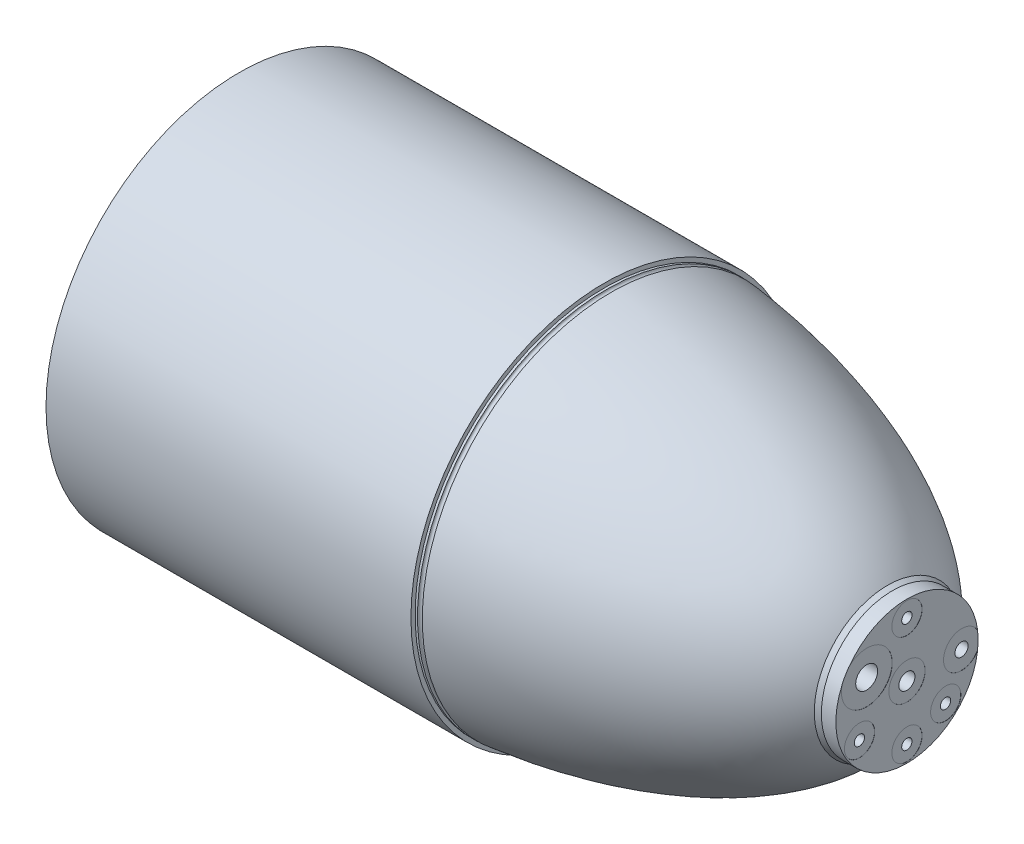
from build123d import *

# Parameters (mm, degrees)
SKETCH2_R         = 13.335
ANT_LAND_DEPTH    = 0.0762
SKETCH3_R         = 5.7531
ANT_THRU_DEPTH    = 25.4
SKETCH4_R         = 4.2164
HYD_THRU_DEPTH    = 50.8
SKETCH5_R         = 9.525
HYD_LAND_DEPTH    = 0.0508
SKETCH6_R         = 7.9375
B_LAND_DEPTH      = 0.0762
SKETCH7_R         = 2.7051
B_THRU_DEPTH      = 50.8
SKETCH8_R         = 9.525
PRESS_LAND_DEPTH  = 0.0762
SKETCH9_R         = 3.4544
PRESS_THRU_DEPTH  = 50.8
SKETCH10_R        = 7.9375
C_LAND_DEPTH      = 0.0762
SKETCH11_R        = 2.7051
C_THRU_DEPTH      = 50.8
SKETCH12_R        = 7.9375
D_LAND_DEPTH      = 0.0762
SKETCH13_R        = 2.7051
D_THRU_DEPTH      = 50.8
SKETCH14_R        = 7.9375
E_LAND_DEPTH      = 0.0762
SKETCH15_R        = 2.7051
E_THRU_DEPTH      = 50.8
INTERIOR_BC_REACH = 345.704
SKETCH19_R        = 2.159


with BuildPart() as part:
    # Sketch1 → Base-Revolve (revolve)
    with BuildSketch(Plane.XY, mode=Mode.PRIVATE) as base_revolve_sk:
        with BuildLine():
            Line((326.394218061, -0.004506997), (350.52, -0.004506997))
            Line((350.52, -0.004506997), (350.52, -37.342506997))
            Line((350.52, -37.342506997), (346.456, -37.342506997))
            Line((346.456, -37.342506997), (342.9, -37.342506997))
            Line((342.9, -37.342506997), (340.36, -38.508146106))
            add(Edge.make_bspline(
                [(195.203659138, -99.071997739), (299.731305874, -87.838190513), (340.36, -38.508146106)],
                knots=[4.924626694, 4.924626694, 4.924626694, 5.893424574, 5.893424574, 5.893424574], degree=2, weights=[1, 0.884955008, 1]))
            ThreePointArc((195.203659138, -99.071997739), (193.957327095, -97.900670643), (192.786, -99.147002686))
            Line((192.786, -99.147002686), (191.516, -99.147002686))
            Line((191.516, -99.147002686), (191.516, -101.346))
            Line((191.516, -101.346), (0, -101.346))
            Line((0, -101.346), (0, -95.5294))
            Line((0, -95.5294), (2.032, -95.5294))
            ThreePointArc((2.032, -95.5294), (3.683, -97.1804), (5.334, -95.5294))
            Line((5.334, -95.5294), (25.9334, -95.5294))
            Line((25.9334, -95.5294), (28.4734, -94.996))
            Line((28.4734, -94.996), (38.1254, -94.996))
            Line((38.1254, -94.996), (38.1254, -87.63))
            Line((38.1254, -87.63), (44.4754, -87.63))
            Line((44.4754, -87.63), (44.4754, -94.996))
            Line((44.4754, -94.996), (181.8894, -94.996))
            Line((181.8894, -94.996), (187.9854, -89.154))
            Line((187.9854, -89.154), (214.293552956, -89.154))
            add(Edge.make_bspline(
                [(214.293552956, -89.154), (289.960887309, -77.024720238), (326.394218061, -42.927072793)],
                knots=[5.034372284, 5.034372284, 5.034372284, 5.808847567, 5.808847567, 5.808847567], degree=2, weights=[1, 0.925955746, 1]))
            Line((326.394218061, -42.927072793), (326.394218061, -0.004506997))
        make_face()
    revolve(base_revolve_sk.sketch.rotate(Axis((355.6, 0, 0), (-1, 0, 0)), 270), axis=Axis((355.6, 0, 0), (-1, 0, 0)))

    # Sketch2 → ANT_LAND (cut)
    with BuildSketch(Plane(origin=(350.52, 0, 0), x_dir=(0, 0, -1), z_dir=(1, 0, 0))):
        with Locations((-21.082, 12.192)):
            Circle(SKETCH2_R)
    extrude(amount=-ANT_LAND_DEPTH, mode=Mode.SUBTRACT)

    # Sketch3 → ant_thru (cut)
    with BuildSketch(Plane(origin=(350.4438, 0, 0), x_dir=(0, 0, -1), z_dir=(1, 0, 0))):
        with Locations((-21.082, 12.192)):
            Circle(SKETCH3_R)
    extrude(amount=-ANT_THRU_DEPTH, mode=Mode.SUBTRACT)

    # Sketch4 → HYD_THRU (cut)
    with BuildSketch(Plane(origin=(350.52, 0, 0), x_dir=(0, 0, -1), z_dir=(1, 0, 0))):
        Circle(SKETCH4_R)
    extrude(amount=-HYD_THRU_DEPTH, mode=Mode.SUBTRACT)

    # Sketch5 → HYD_LAND (cut)
    with BuildSketch(Plane(origin=(350.52, 0, 0), x_dir=(0, 0, -1), z_dir=(1, 0, 0))):
        Circle(SKETCH5_R)
    extrude(amount=-HYD_LAND_DEPTH, mode=Mode.SUBTRACT)

    # Sketch6 → B_LAND (cut)
    with BuildSketch(Plane(origin=(350.52, 0, 0), x_dir=(0, 0, -1), z_dir=(1, 0, 0))):
        with Locations((0, 28.702)):
            Circle(SKETCH6_R)
    extrude(amount=-B_LAND_DEPTH, mode=Mode.SUBTRACT)

    # Sketch7 → B_THRU (cut)
    with BuildSketch(Plane(origin=(350.4438, 0, 0), x_dir=(0, 0, -1), z_dir=(1, 0, 0))):
        with Locations((0, 28.702)):
            Circle(SKETCH7_R)
    extrude(amount=-B_THRU_DEPTH, mode=Mode.SUBTRACT)

    # Sketch8 → PRESS_LAND (cut)
    with BuildSketch(Plane(origin=(350.52, 0, 0), x_dir=(0, 0, -1), z_dir=(1, 0, 0))):
        with Locations((28.702, 0)):
            Circle(SKETCH8_R)
    extrude(amount=-PRESS_LAND_DEPTH, mode=Mode.SUBTRACT)

    # Sketch9 → PRESS_THRU (cut)
    with BuildSketch(Plane(origin=(350.4438, 0, 0), x_dir=(0, 0, -1), z_dir=(1, 0, 0))):
        with Locations((28.702, 0)):
            Circle(SKETCH9_R)
    extrude(amount=-PRESS_THRU_DEPTH, mode=Mode.SUBTRACT)

    # Sketch10 → C_LAND (cut)
    with BuildSketch(Plane(origin=(350.52, 0, 0), x_dir=(0, 0, -1), z_dir=(1, 0, 0))):
        with Locations((20.32, -20.32)):
            Circle(SKETCH10_R)
    extrude(amount=-C_LAND_DEPTH, mode=Mode.SUBTRACT)

    # Sketch11 → C_THRU (cut)
    with BuildSketch(Plane(origin=(350.4438, 0, 0), x_dir=(0, 0, -1), z_dir=(1, 0, 0))):
        with Locations((20.32, -20.32)):
            Circle(SKETCH11_R)
    extrude(amount=-C_THRU_DEPTH, mode=Mode.SUBTRACT)

    # Sketch12 → D_LAND (cut)
    with BuildSketch(Plane(origin=(350.52, 0, 0), x_dir=(0, 0, -1), z_dir=(1, 0, 0))):
        with Locations((0, -28.702)):
            Circle(SKETCH12_R)
    extrude(amount=-D_LAND_DEPTH, mode=Mode.SUBTRACT)

    # Sketch13 → D_THRU (cut)
    with BuildSketch(Plane(origin=(350.4438, 0, 0), x_dir=(0, 0, -1), z_dir=(1, 0, 0))):
        with Locations((0, -28.702)):
            Circle(SKETCH13_R)
    extrude(amount=-D_THRU_DEPTH, mode=Mode.SUBTRACT)

    # Sketch14 → E_LAND (cut)
    with BuildSketch(Plane(origin=(350.52, 0, 0), x_dir=(0, 0, -1), z_dir=(1, 0, 0))):
        with Locations((-24.892, -14.478)):
            Circle(SKETCH14_R)
    extrude(amount=-E_LAND_DEPTH, mode=Mode.SUBTRACT)

    # Sketch15 → E_THRU (cut)
    with BuildSketch(Plane(origin=(350.4438, 0, 0), x_dir=(0, 0, -1), z_dir=(1, 0, 0))):
        with Locations((-24.892, -14.478)):
            Circle(SKETCH15_R)
    extrude(amount=-E_THRU_DEPTH, mode=Mode.SUBTRACT)

    # Sketch19 → interior_bc (cut, up to next)
    with BuildSketch(Plane.ZY.offset(-38.1254), mode=Mode.PRIVATE) as interior_bc_sk1:
        with Locations((0, 91.44)):
            Circle(SKETCH19_R)
    interior_bc_tool1 = extrude(interior_bc_sk1.sketch, amount=-INTERIOR_BC_REACH, mode=Mode.PRIVATE) & part.part
    # Sketch19 → interior_bc (cut, up to next)
    with BuildSketch(Plane.ZY.offset(-38.1254), mode=Mode.PRIVATE) as interior_bc_sk2:
        with Locations((64.657844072, 64.657844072)):
            Circle(SKETCH19_R)
    interior_bc_tool2 = extrude(interior_bc_sk2.sketch, amount=-INTERIOR_BC_REACH, mode=Mode.PRIVATE) & part.part
    # Sketch19 → interior_bc (cut, up to next)
    with BuildSketch(Plane.ZY.offset(-38.1254), mode=Mode.PRIVATE) as interior_bc_sk3:
        with Locations((91.44, 0)):
            Circle(SKETCH19_R)
    interior_bc_tool3 = extrude(interior_bc_sk3.sketch, amount=-INTERIOR_BC_REACH, mode=Mode.PRIVATE) & part.part
    # Sketch19 → interior_bc (cut, up to next)
    with BuildSketch(Plane.ZY.offset(-38.1254), mode=Mode.PRIVATE) as interior_bc_sk4:
        with Locations((64.657844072, -64.657844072)):
            Circle(SKETCH19_R)
    interior_bc_tool4 = extrude(interior_bc_sk4.sketch, amount=-INTERIOR_BC_REACH, mode=Mode.PRIVATE) & part.part
    # Sketch19 → interior_bc (cut, up to next)
    with BuildSketch(Plane.ZY.offset(-38.1254), mode=Mode.PRIVATE) as interior_bc_sk5:
        with Locations((0, -91.44)):
            Circle(SKETCH19_R)
    interior_bc_tool5 = extrude(interior_bc_sk5.sketch, amount=-INTERIOR_BC_REACH, mode=Mode.PRIVATE) & part.part
    # Sketch19 → interior_bc (cut, up to next)
    with BuildSketch(Plane.ZY.offset(-38.1254), mode=Mode.PRIVATE) as interior_bc_sk6:
        with Locations((-64.657844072, -64.657844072)):
            Circle(SKETCH19_R)
    interior_bc_tool6 = extrude(interior_bc_sk6.sketch, amount=-INTERIOR_BC_REACH, mode=Mode.PRIVATE) & part.part
    # Sketch19 → interior_bc (cut, up to next)
    with BuildSketch(Plane.ZY.offset(-38.1254), mode=Mode.PRIVATE) as interior_bc_sk7:
        with Locations((-91.44, 0)):
            Circle(SKETCH19_R)
    interior_bc_tool7 = extrude(interior_bc_sk7.sketch, amount=-INTERIOR_BC_REACH, mode=Mode.PRIVATE) & part.part
    # Sketch19 → interior_bc (cut, up to next)
    with BuildSketch(Plane.ZY.offset(-38.1254), mode=Mode.PRIVATE) as interior_bc_sk8:
        with Locations((-64.657844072, 64.657844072)):
            Circle(SKETCH19_R)
    interior_bc_tool8 = extrude(interior_bc_sk8.sketch, amount=-INTERIOR_BC_REACH, mode=Mode.PRIVATE) & part.part
    add(interior_bc_tool1.solids().sort_by_distance((38.1254, 91.44, 0))[0], mode=Mode.SUBTRACT)
    add(interior_bc_tool2.solids().sort_by_distance((38.1254, 64.657844, 64.657844))[0], mode=Mode.SUBTRACT)
    add(interior_bc_tool3.solids().sort_by_distance((38.1254, 0, 91.44))[0], mode=Mode.SUBTRACT)
    add(interior_bc_tool4.solids().sort_by_distance((38.1254, -64.657844, 64.657844))[0], mode=Mode.SUBTRACT)
    add(interior_bc_tool5.solids().sort_by_distance((38.1254, -91.44, 0))[0], mode=Mode.SUBTRACT)
    add(interior_bc_tool6.solids().sort_by_distance((38.1254, -64.657844, -64.657844))[0], mode=Mode.SUBTRACT)
    add(interior_bc_tool7.solids().sort_by_distance((38.1254, 0, -91.44))[0], mode=Mode.SUBTRACT)
    add(interior_bc_tool8.solids().sort_by_distance((38.1254, 64.657844, -64.657844))[0], mode=Mode.SUBTRACT)


solid = part.part
